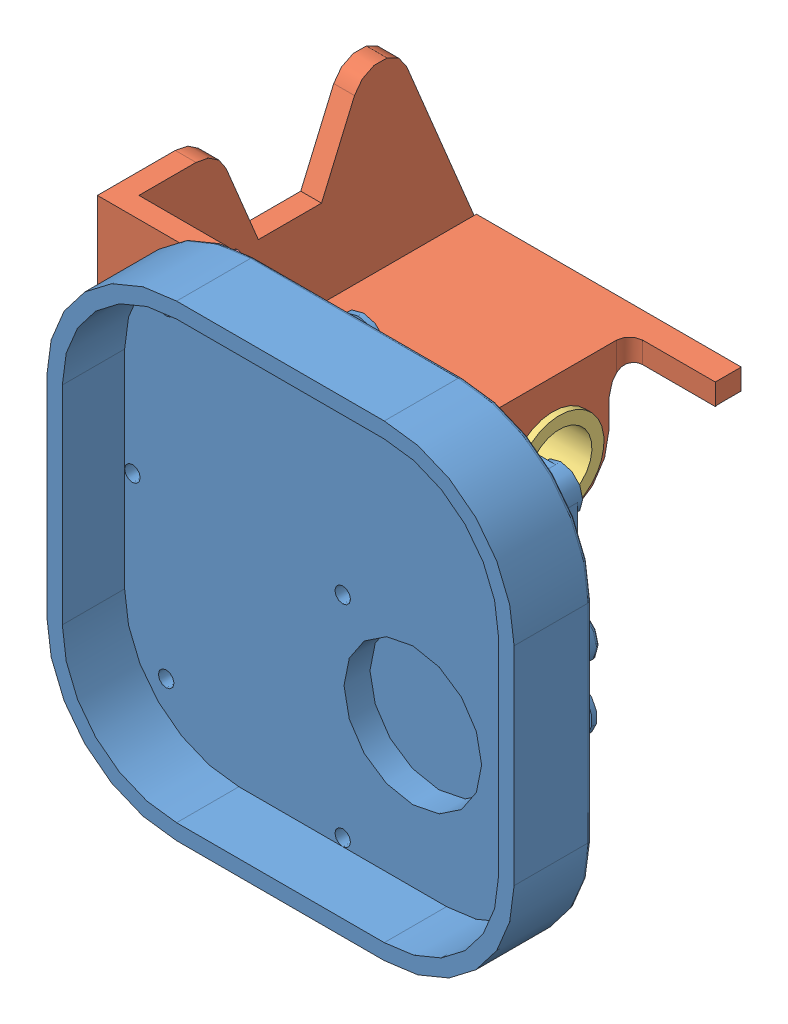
SolidWorks assembly Bati.SLDASM, configuration Défaut (file format 11000). Lengths in mm.
Overall size (406 360 356).
7 component instances, 4 part files, 13 mates.
Components (placement in the parent):
- reducteur-1: reducteur.SLDPRT [Défaut] at (-252.4721 -127.2379 27) size (360 360 174)
- Bati-1: Bati.SLDPRT [Défaut] at (-293.4721 42.2621 7) x (0 -1 0) z (1 0 0) size (301 276 243)
- Bague-1: Bague.SLDPRT [Défaut] at (-134.4721 -7.2379 -190) x (-1 0 0) z (0 0.924225 -0.381849) size (50 68.6 68.6)
- Bague-2: Bague.SLDPRT [Défaut] at (-298.4721 -7.2379 -190) x (1 0 0) z (0 0.094472 0.995528) size (50 68.6 68.6)
- Vis-1: Vis.SLDPRT [M8-1.25] at (-208.4721 -71.2379 -9) x (0.133526 0.991045 0) z (0 0 -1) size (27 27 38)
- Vis-2: Vis.SLDPRT [M8-1.25] at (-72.4721 52.7621 -9) x (0.375037 -0.92701 0) z (0 0 -1) size (27 27 38)
- Vis-3: Vis.SLDPRT [M8-1.25] at (-208.4721 176.7621 -9) x (0.607105 -0.794622 0) z (0 0 -1) size (27 27 38)
Mates (geometry in assembly coordinates):
- Coïncidente1: coincident: plane of reducteur-1 through (-18.4721 -7.2379 7) normal (0 0 -1); plane of Bati-1 through (-277.4721 192.7621 7) normal (0 0 1)
- Concentrique1: concentric: cylinder of reducteur-1 through (-208.4721 -71.2379 87) axis (0 0 -1) radius 6; cylinder of Bati-1 through (-208.4721 -71.2379 7) axis (0 0 -1) radius 6.5
- Concentrique2: concentric: cylinder of reducteur-1 through (-208.4721 176.7621 87) axis (0 0 -1) radius 6; cylinder of Bati-1 through (-208.4721 176.7621 7) axis (0 0 -1) radius 6.5
- Coïncidente4: coincident: plane of Bati-1 through (-139.4721 34.2621 -239) normal (1 0 0); plane of Bague-1 through (-139.4721 -20.3354 -221.7009) normal (-1 0 0)
- Concentrique4: concentric: cylinder of Bati-1 through (-293.4721 -7.2379 -190) axis (1 0 0) radius 29; cylinder of Bague-1 through (-134.4721 -7.2379 -190) axis (1 0 0) radius 25
- Coïncidente5: coincident: plane of Bati-1 through (-293.4721 -83.2379 -195) normal (-1 0 0); plane of Bague-2 through (-293.4721 -41.3845 -186.7596) normal (1 0 0)
- Concentrique5: concentric: cylinder of Bati-1 through (-293.4721 -7.2379 -190) axis (1 0 0) radius 29; cylinder of Bague-2 through (-298.4721 -7.2379 -190) axis (-1 0 0) radius 29
- Coïncidente7: coincident: plane of Bati-1 through (-208.4721 176.7621 -9) normal (0 0 -1); plane of Vis-1 through (-210.8755 -89.0767 -9) normal (0 0 1)
- Concentrique8: concentric: cylinder of Bati-1 through (-208.4721 -71.2379 7) axis (0 0 -1) radius 6.5; cylinder of Vis-1 through (-208.4721 -71.2379 21) axis (0 0 -1) radius 6
- Coïncidente8: coincident: plane of Bati-1 through (-208.4721 176.7621 -9) normal (0 0 -1); plane of Vis-3 through (-219.3999 191.0653 -9) normal (0 0 1)
- Coïncidente9: coincident: plane of Bati-1 through (-208.4721 176.7621 -9) normal (0 0 -1); plane of Vis-2 through (-79.2227 69.4483 -9) normal (0 0 1)
- Concentrique9: concentric: cylinder of Bati-1 through (-72.4721 52.7621 7) axis (0 0 -1) radius 6.5; cylinder of Vis-2 through (-72.4721 52.7621 21) axis (0 0 -1) radius 6
- Concentrique10: concentric: cylinder of Bati-1 through (-208.4721 176.7621 7) axis (0 0 -1) radius 6.5; cylinder of Vis-3 through (-208.4721 176.7621 21) axis (0 0 -1) radius 6
